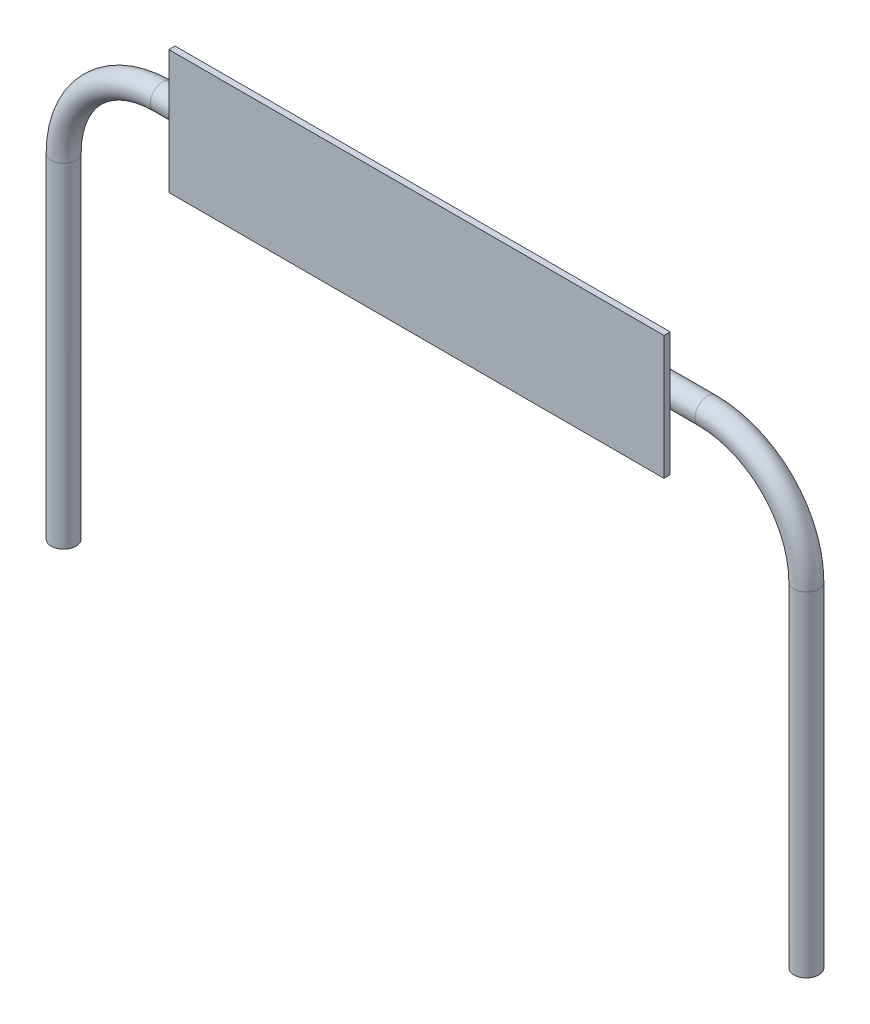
from build123d import *

# Parameters (mm, degrees)
BOSS_EXTRUDE1_START = 304.8
SKETCH1_W           = 12192
SKETCH1_H           = 3048
BOSS_EXTRUDE1_DEPTH = 152.4
SKETCH4_R           = 304.8
BOSS_EXTRUDE4_START = 2438.4
BOSS_EXTRUDE4_DEPTH = 457.2


with BuildPart() as part:
    # Sketch1 → Boss-Extrude1 (new body)
    with BuildSketch(Plane.XY.offset(BOSS_EXTRUDE1_START)):
        Rectangle(SKETCH1_W, SKETCH1_H)
    extrude(amount=BOSS_EXTRUDE1_DEPTH)


with BuildPart() as body_2:
    # Sweep2: sweep along a path in Sketch2
    with BuildLine(Plane.XY) as sweep2_path:
        Line((-9144, -10668), (-9144, -2438.4))
        ThreePointArc((-9144, -2438.4), (-8429.809175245, -714.190824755), (-6705.6, 0))
        Line((-6705.6, 0), (6705.6, 0))
        ThreePointArc((6705.6, 0), (8429.809175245, -714.190824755), (9144, -2438.4))
        Line((9144, -2438.4), (9144, -10668))
    # Sketch4 → Sweep2 (sweep)
    with BuildSketch(Plane(origin=(0, -10668, 0), x_dir=(-1, 0, 0), z_dir=(0, 1, 0))):
        with Locations((-9144, 0)):
            Circle(SKETCH4_R)
    sweep(path=sweep2_path.line)


with BuildPart() as body_3:
    # Sketch5 → Boss-Extrude4 (new body)
    with BuildSketch(Plane(origin=(0, 0, 0), x_dir=(0, 0, -1), z_dir=(1, 0, 0)).offset(BOSS_EXTRUDE4_START)):
        with BuildLine():
            Line((0, 304.8), (-182.88, 304.8))
            ThreePointArc((-182.88, 304.8), (-269.090458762, 340.509541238), (-304.8, 426.72))
            Line((-304.8, 426.72), (-304.8, 609.6))
            Line((-304.8, 609.6), (-213.36, 609.6))
            Line((-213.36, 609.6), (-213.36, 426.72))
            ThreePointArc((-213.36, 426.72), (-204.432614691, 405.167385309), (-182.88, 396.24))
            Line((-182.88, 396.24), (0, 396.24))
            ThreePointArc((0, 396.24), (396.24, 0), (0, -396.24))
            Line((0, -396.24), (-182.88, -396.24))
            ThreePointArc((-182.88, -396.24), (-204.432614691, -405.167385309), (-213.36, -426.72))
            Line((-213.36, -426.72), (-213.36, -609.6))
            Line((-213.36, -609.6), (-304.8, -609.6))
            Line((-304.8, -609.6), (-304.8, -426.72))
            ThreePointArc((-304.8, -426.72), (-269.090458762, -340.509541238), (-182.88, -304.8))
            Line((-182.88, -304.8), (0, -304.8))
            ThreePointArc((0, -304.8), (304.8, 0), (0, 304.8))
        make_face()
    extrude(amount=BOSS_EXTRUDE4_DEPTH)


with BuildPart() as body_4:
    # Mirror1: mirrored copy
    add(body_3.part.mirror(Plane(origin=(0, 0, 0), x_dir=(0, 0, -1), z_dir=(1, 0, 0))))


solid = Compound([part.part, body_2.part, body_3.part, body_4.part])
